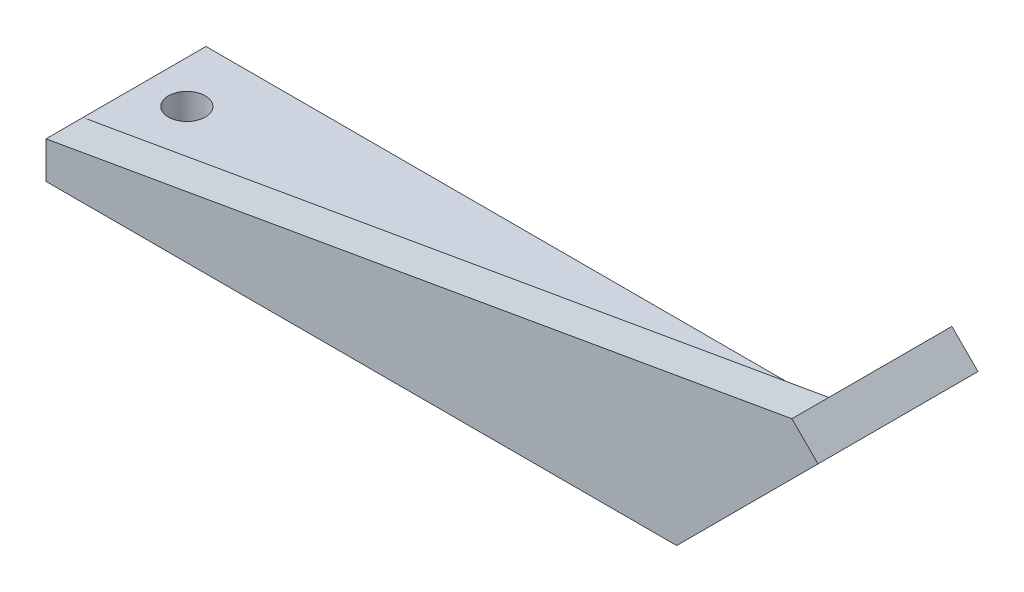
from build123d import *

# Parameters (mm, degrees)
EXTRUDE_1_DEPTH          = 10
EXTRUDE_2_DEPTH          = 3
SKETCH_4_R               = 1.5
CUT_EXTRUDE_1_DEPTH      = 3
CUT_EXTRUDE_2_DEPTH      = 30
CUT_EXTRUDE_2_DEPTH_BACK = 30
SKETCH_6_R               = 1.5
CUT_EXTRUDE_3_DEPTH      = 30


with BuildPart() as part:
    # Sketch 1 → Extrude 1 (new body)
    with BuildSketch(Plane.XY):
        Polygon((0, 0), (10.606601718, 10.606601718), (12.727922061, 8.485281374), (1.242640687, -3), (-50, -3), (-50, 0), align=None)
    extrude_1 = extrude(amount=EXTRUDE_1_DEPTH)

    # Sketch 3 → Extrude 2 (add)
    with BuildSketch(Plane(origin=(0, 0, 0), x_dir=(-1, 0, 0), z_dir=(0, 0, -1))):
        Polygon((-10.606601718, 10.606601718), (50, 0), (50, -3), (-1.242640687, -3), (-12.727922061, 8.485281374), align=None)
    extrude_2 = extrude(amount=EXTRUDE_2_DEPTH)

    # Sketch 4 → Cut-Extrude 1 (cut)
    with BuildSketch(Plane(origin=(0, 0, 0), x_dir=(0, 0, 1), z_dir=(-0.7071067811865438, 0.7071067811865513, 0))):
        with Locations(Location((5, 7.83, 0), (0, 0, 270))):
            Circle(SKETCH_4_R)
    cut_extrude_1 = extrude(amount=-CUT_EXTRUDE_1_DEPTH, mode=Mode.SUBTRACT)

    # Mirror 1: Extrude 1, Extrude 2, Cut-Extrude 1 across plane
    add(extrude_1.mirror(Plane.XY.offset(10)))
    add(extrude_2.mirror(Plane.XY.offset(10)))
    add(cut_extrude_1.mirror(Plane.XY.offset(10)), mode=Mode.SUBTRACT)

    # Sketch 5 → Cut-Extrude 2 (cut, two sides: drawn at the far end of the back side and taken through both)
    with BuildSketch(Plane(origin=(0, 0, 0), x_dir=(1, 0, 0), z_dir=(0, 1, 0)).offset(-CUT_EXTRUDE_2_DEPTH_BACK)):
        Polygon((-50, -10), (26.270815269, -10), (26.270815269, 10.689539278), (-70, 10.689539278), align=None)
    extrude(amount=CUT_EXTRUDE_2_DEPTH + CUT_EXTRUDE_2_DEPTH_BACK, mode=Mode.SUBTRACT)

    # Sketch 6 → Cut-Extrude 3 (cut)
    with BuildSketch(Plane(origin=(0, 0, 0), x_dir=(1, 0, 0), z_dir=(0, 1, 0))):
        with Locations(Location((-46.55735931, -15, 0), (0, 0, 180))):
            Circle(SKETCH_6_R)
    extrude(amount=-CUT_EXTRUDE_3_DEPTH, mode=Mode.SUBTRACT)


solid = part.part
